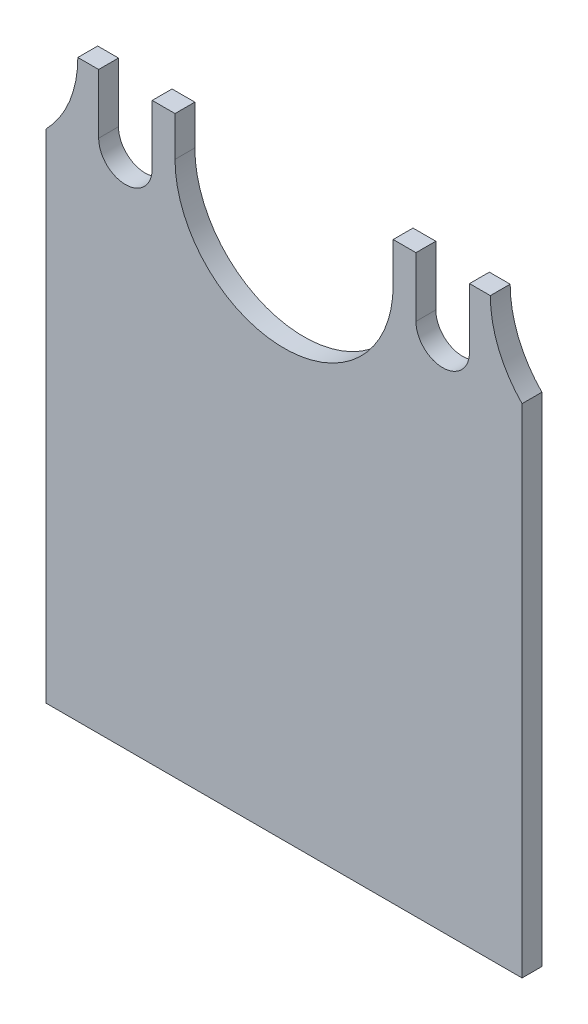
ISO-10303-21;
HEADER;
FILE_DESCRIPTION(('STEP AP214'),'2;1');
FILE_NAME('part.step','',(''),(''),'','','');
FILE_SCHEMA(('AUTOMOTIVE_DESIGN { 1 0 10303 214 1 1 1 1 }'));
ENDSEC;
DATA;
#1=APPLICATION_CONTEXT('core data for automotive mechanical design processes');
#2=APPLICATION_PROTOCOL_DEFINITION('international standard','automotive_design',2000,#1);
#3=PRODUCT_CONTEXT('',#1,'mechanical');
#4=PRODUCT('Part','Part','',(#3));
#5=PRODUCT_RELATED_PRODUCT_CATEGORY('part','',(#4));
#6=PRODUCT_DEFINITION_FORMATION('','',#4);
#7=PRODUCT_DEFINITION_CONTEXT('part definition',#1,'design');
#8=PRODUCT_DEFINITION('design','',#6,#7);
#9=PRODUCT_DEFINITION_SHAPE('','',#8);
#10=(LENGTH_UNIT() NAMED_UNIT(*) SI_UNIT(.MILLI.,.METRE.));
#11=(NAMED_UNIT(*) PLANE_ANGLE_UNIT() SI_UNIT($,.RADIAN.));
#12=(NAMED_UNIT(*) SI_UNIT($,.STERADIAN.) SOLID_ANGLE_UNIT());
#13=UNCERTAINTY_MEASURE_WITH_UNIT(LENGTH_MEASURE(1.E-05),#10,'distance_accuracy_value','');
#14=(GEOMETRIC_REPRESENTATION_CONTEXT(3) GLOBAL_UNCERTAINTY_ASSIGNED_CONTEXT((#13)) GLOBAL_UNIT_ASSIGNED_CONTEXT((#10,
#11,#12)) REPRESENTATION_CONTEXT('',''));
#15=CARTESIAN_POINT('',(0.,0.,0.));
#16=DIRECTION('',(0.,0.,1.));
#17=DIRECTION('',(1.,0.,0.));
#18=AXIS2_PLACEMENT_3D('',#15,#16,#17);
#19=CARTESIAN_POINT('',(0.,0.,5.));
#20=DIRECTION('',(1.,0.,0.));
#21=DIRECTION('',(0.,0.,-1.));
#22=AXIS2_PLACEMENT_3D('',#19,#20,#21);
#23=PLANE('',#22);
#24=DIRECTION('',(0.,-1.,0.));
#25=VECTOR('',#24,1.);
#26=CARTESIAN_POINT('',(0.,0.,0.));
#27=LINE('',#26,#25);
#28=CARTESIAN_POINT('',(0.,125.404082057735,0.));
#29=VERTEX_POINT('',#28);
#30=CARTESIAN_POINT('',(0.,0.,0.));
#31=VERTEX_POINT('',#30);
#32=EDGE_CURVE('E157',#29,#31,#27,.T.);
#33=ORIENTED_EDGE('',*,*,#32,.T.);
#34=DIRECTION('',(0.,0.,-1.));
#35=VECTOR('',#34,1.);
#36=CARTESIAN_POINT('',(0.,0.,5.));
#37=LINE('',#36,#35);
#38=CARTESIAN_POINT('',(0.,0.,5.));
#39=VERTEX_POINT('',#38);
#40=EDGE_CURVE('E11',#39,#31,#37,.T.);
#41=ORIENTED_EDGE('',*,*,#40,.F.);
#42=DIRECTION('',(0.,-1.,0.));
#43=VECTOR('',#42,1.);
#44=CARTESIAN_POINT('',(0.,0.,5.));
#45=LINE('',#44,#43);
#46=CARTESIAN_POINT('',(0.,125.404082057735,5.));
#47=VERTEX_POINT('',#46);
#48=EDGE_CURVE('E204',#47,#39,#45,.T.);
#49=ORIENTED_EDGE('',*,*,#48,.F.);
#50=DIRECTION('',(0.,0.,-1.));
#51=VECTOR('',#50,1.);
#52=CARTESIAN_POINT('',(0.,125.404082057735,5.));
#53=LINE('',#52,#51);
#54=EDGE_CURVE('E170',#47,#29,#53,.T.);
#55=ORIENTED_EDGE('',*,*,#54,.T.);
#56=EDGE_LOOP('',(#33,#41,#49,#55));
#57=FACE_BOUND('',#56,.T.);
#58=ADVANCED_FACE('F29',(#57),#23,.F.);
#59=CARTESIAN_POINT('',(0.,0.,5.));
#60=DIRECTION('',(0.,1.,0.));
#61=DIRECTION('',(0.,0.,1.));
#62=AXIS2_PLACEMENT_3D('',#59,#60,#61);
#63=PLANE('',#62);
#64=DIRECTION('',(1.,0.,0.));
#65=VECTOR('',#64,1.);
#66=CARTESIAN_POINT('',(0.,0.,0.));
#67=LINE('',#66,#65);
#68=CARTESIAN_POINT('',(120.,0.,0.));
#69=VERTEX_POINT('',#68);
#70=EDGE_CURVE('E153',#31,#69,#67,.T.);
#71=ORIENTED_EDGE('',*,*,#70,.T.);
#72=DIRECTION('',(0.,0.,-1.));
#73=VECTOR('',#72,1.);
#74=CARTESIAN_POINT('',(120.,0.,5.));
#75=LINE('',#74,#73);
#76=CARTESIAN_POINT('',(120.,0.,5.));
#77=VERTEX_POINT('',#76);
#78=EDGE_CURVE('E36',#77,#69,#75,.T.);
#79=ORIENTED_EDGE('',*,*,#78,.F.);
#80=DIRECTION('',(1.,0.,0.));
#81=VECTOR('',#80,1.);
#82=CARTESIAN_POINT('',(0.,0.,5.));
#83=LINE('',#82,#81);
#84=EDGE_CURVE('E166',#39,#77,#83,.T.);
#85=ORIENTED_EDGE('',*,*,#84,.F.);
#86=ORIENTED_EDGE('',*,*,#40,.T.);
#87=EDGE_LOOP('',(#71,#79,#85,#86));
#88=FACE_BOUND('',#87,.T.);
#89=ADVANCED_FACE('F165',(#88),#63,.F.);
#90=CARTESIAN_POINT('',(120.,0.,5.));
#91=DIRECTION('',(-1.,0.,0.));
#92=DIRECTION('',(0.,0.,1.));
#93=AXIS2_PLACEMENT_3D('',#90,#91,#92);
#94=PLANE('',#93);
#95=DIRECTION('',(0.,1.,0.));
#96=VECTOR('',#95,1.);
#97=CARTESIAN_POINT('',(120.,0.,0.));
#98=LINE('',#97,#96);
#99=CARTESIAN_POINT('',(120.,125.404082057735,0.));
#100=VERTEX_POINT('',#99);
#101=EDGE_CURVE('E159',#69,#100,#98,.T.);
#102=ORIENTED_EDGE('',*,*,#101,.T.);
#103=DIRECTION('',(0.,0.,-1.));
#104=VECTOR('',#103,1.);
#105=CARTESIAN_POINT('',(120.,125.404082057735,5.));
#106=LINE('',#105,#104);
#107=CARTESIAN_POINT('',(120.,125.404082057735,5.));
#108=VERTEX_POINT('',#107);
#109=EDGE_CURVE('E280',#108,#100,#106,.T.);
#110=ORIENTED_EDGE('',*,*,#109,.F.);
#111=DIRECTION('',(0.,1.,0.));
#112=VECTOR('',#111,1.);
#113=CARTESIAN_POINT('',(120.,0.,5.));
#114=LINE('',#113,#112);
#115=EDGE_CURVE('E207',#77,#108,#114,.T.);
#116=ORIENTED_EDGE('',*,*,#115,.F.);
#117=ORIENTED_EDGE('',*,*,#78,.T.);
#118=EDGE_LOOP('',(#102,#110,#116,#117));
#119=FACE_BOUND('',#118,.T.);
#120=ADVANCED_FACE('F284',(#119),#94,.F.);
#121=CARTESIAN_POINT('',(140.,145.,5.));
#122=DIRECTION('',(0.,0.,-1.));
#123=DIRECTION('',(-1.,0.,0.));
#124=AXIS2_PLACEMENT_3D('',#121,#122,#123);
#125=CYLINDRICAL_SURFACE('',#124,28.);
#126=CARTESIAN_POINT('',(140.,145.,0.));
#127=DIRECTION('',(0.,0.,-1.));
#128=DIRECTION('',(1.,0.,0.));
#129=AXIS2_PLACEMENT_3D('',#126,#127,#128);
#130=CIRCLE('',#129,28.);
#131=CARTESIAN_POINT('',(112.,145.,0.));
#132=VERTEX_POINT('',#131);
#133=EDGE_CURVE('E174',#100,#132,#130,.T.);
#134=ORIENTED_EDGE('',*,*,#133,.T.);
#135=DIRECTION('',(0.,0.,-1.));
#136=VECTOR('',#135,1.);
#137=CARTESIAN_POINT('',(112.,145.,5.));
#138=LINE('',#137,#136);
#139=CARTESIAN_POINT('',(112.,145.,5.));
#140=VERTEX_POINT('',#139);
#141=EDGE_CURVE('E277',#140,#132,#138,.T.);
#142=ORIENTED_EDGE('',*,*,#141,.F.);
#143=CARTESIAN_POINT('',(140.,145.,5.));
#144=DIRECTION('',(0.,0.,-1.));
#145=DIRECTION('',(1.,0.,0.));
#146=AXIS2_PLACEMENT_3D('',#143,#144,#145);
#147=CIRCLE('',#146,28.);
#148=EDGE_CURVE('E209',#108,#140,#147,.T.);
#149=ORIENTED_EDGE('',*,*,#148,.F.);
#150=ORIENTED_EDGE('',*,*,#109,.T.);
#151=EDGE_LOOP('',(#134,#142,#149,#150));
#152=FACE_BOUND('',#151,.T.);
#153=ADVANCED_FACE('F292',(#152),#125,.F.);
#154=CARTESIAN_POINT('',(106.75,145.,5.));
#155=DIRECTION('',(0.,-1.,0.));
#156=DIRECTION('',(0.,0.,-1.));
#157=AXIS2_PLACEMENT_3D('',#154,#155,#156);
#158=PLANE('',#157);
#159=DIRECTION('',(-1.,0.,0.));
#160=VECTOR('',#159,1.);
#161=CARTESIAN_POINT('',(106.75,145.,0.));
#162=LINE('',#161,#160);
#163=CARTESIAN_POINT('',(106.75,145.,0.));
#164=VERTEX_POINT('',#163);
#165=EDGE_CURVE('E176',#132,#164,#162,.T.);
#166=ORIENTED_EDGE('',*,*,#165,.T.);
#167=DIRECTION('',(0.,0.,-1.));
#168=VECTOR('',#167,1.);
#169=CARTESIAN_POINT('',(106.75,145.,5.));
#170=LINE('',#169,#168);
#171=CARTESIAN_POINT('',(106.75,145.,5.));
#172=VERTEX_POINT('',#171);
#173=EDGE_CURVE('E274',#172,#164,#170,.T.);
#174=ORIENTED_EDGE('',*,*,#173,.F.);
#175=DIRECTION('',(-1.,0.,0.));
#176=VECTOR('',#175,1.);
#177=CARTESIAN_POINT('',(106.75,145.,5.));
#178=LINE('',#177,#176);
#179=EDGE_CURVE('E211',#140,#172,#178,.T.);
#180=ORIENTED_EDGE('',*,*,#179,.F.);
#181=ORIENTED_EDGE('',*,*,#141,.T.);
#182=EDGE_LOOP('',(#166,#174,#180,#181));
#183=FACE_BOUND('',#182,.T.);
#184=ADVANCED_FACE('F295',(#183),#158,.F.);
#185=CARTESIAN_POINT('',(106.75,130.,5.));
#186=DIRECTION('',(1.,0.,0.));
#187=DIRECTION('',(0.,0.,-1.));
#188=AXIS2_PLACEMENT_3D('',#185,#186,#187);
#189=PLANE('',#188);
#190=DIRECTION('',(0.,-1.,0.));
#191=VECTOR('',#190,1.);
#192=CARTESIAN_POINT('',(106.75,130.,0.));
#193=LINE('',#192,#191);
#194=CARTESIAN_POINT('',(106.75,130.,0.));
#195=VERTEX_POINT('',#194);
#196=EDGE_CURVE('E178',#164,#195,#193,.T.);
#197=ORIENTED_EDGE('',*,*,#196,.T.);
#198=DIRECTION('',(0.,0.,-1.));
#199=VECTOR('',#198,1.);
#200=CARTESIAN_POINT('',(106.75,130.,5.));
#201=LINE('',#200,#199);
#202=CARTESIAN_POINT('',(106.75,130.,5.));
#203=VERTEX_POINT('',#202);
#204=EDGE_CURVE('E271',#203,#195,#201,.T.);
#205=ORIENTED_EDGE('',*,*,#204,.F.);
#206=DIRECTION('',(0.,-1.,0.));
#207=VECTOR('',#206,1.);
#208=CARTESIAN_POINT('',(106.75,130.,5.));
#209=LINE('',#208,#207);
#210=EDGE_CURVE('E213',#172,#203,#209,.T.);
#211=ORIENTED_EDGE('',*,*,#210,.F.);
#212=ORIENTED_EDGE('',*,*,#173,.T.);
#213=EDGE_LOOP('',(#197,#205,#211,#212));
#214=FACE_BOUND('',#213,.T.);
#215=ADVANCED_FACE('F300',(#214),#189,.F.);
#216=CARTESIAN_POINT('',(100.,130.,5.));
#217=DIRECTION('',(0.,0.,-1.));
#218=DIRECTION('',(-1.,0.,0.));
#219=AXIS2_PLACEMENT_3D('',#216,#217,#218);
#220=CYLINDRICAL_SURFACE('',#219,6.75000000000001);
#221=CARTESIAN_POINT('',(100.,130.,0.));
#222=DIRECTION('',(0.,0.,-1.));
#223=DIRECTION('',(1.,0.,0.));
#224=AXIS2_PLACEMENT_3D('',#221,#222,#223);
#225=CIRCLE('',#224,6.75000000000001);
#226=CARTESIAN_POINT('',(93.25,130.,0.));
#227=VERTEX_POINT('',#226);
#228=EDGE_CURVE('E180',#195,#227,#225,.T.);
#229=ORIENTED_EDGE('',*,*,#228,.T.);
#230=DIRECTION('',(0.,0.,-1.));
#231=VECTOR('',#230,1.);
#232=CARTESIAN_POINT('',(93.25,130.,5.));
#233=LINE('',#232,#231);
#234=CARTESIAN_POINT('',(93.25,130.,5.));
#235=VERTEX_POINT('',#234);
#236=EDGE_CURVE('E268',#235,#227,#233,.T.);
#237=ORIENTED_EDGE('',*,*,#236,.F.);
#238=CARTESIAN_POINT('',(100.,130.,5.));
#239=DIRECTION('',(0.,0.,-1.));
#240=DIRECTION('',(1.,0.,0.));
#241=AXIS2_PLACEMENT_3D('',#238,#239,#240);
#242=CIRCLE('',#241,6.75000000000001);
#243=EDGE_CURVE('E215',#203,#235,#242,.T.);
#244=ORIENTED_EDGE('',*,*,#243,.F.);
#245=ORIENTED_EDGE('',*,*,#204,.T.);
#246=EDGE_LOOP('',(#229,#237,#244,#245));
#247=FACE_BOUND('',#246,.T.);
#248=ADVANCED_FACE('F306',(#247),#220,.F.);
#249=CARTESIAN_POINT('',(93.25,130.,5.));
#250=DIRECTION('',(-1.,0.,0.));
#251=DIRECTION('',(0.,0.,1.));
#252=AXIS2_PLACEMENT_3D('',#249,#250,#251);
#253=PLANE('',#252);
#254=DIRECTION('',(0.,1.,0.));
#255=VECTOR('',#254,1.);
#256=CARTESIAN_POINT('',(93.25,130.,0.));
#257=LINE('',#256,#255);
#258=CARTESIAN_POINT('',(93.25,145.,0.));
#259=VERTEX_POINT('',#258);
#260=EDGE_CURVE('E182',#227,#259,#257,.T.);
#261=ORIENTED_EDGE('',*,*,#260,.T.);
#262=DIRECTION('',(0.,0.,-1.));
#263=VECTOR('',#262,1.);
#264=CARTESIAN_POINT('',(93.25,145.,5.));
#265=LINE('',#264,#263);
#266=CARTESIAN_POINT('',(93.25,145.,5.));
#267=VERTEX_POINT('',#266);
#268=EDGE_CURVE('E265',#267,#259,#265,.T.);
#269=ORIENTED_EDGE('',*,*,#268,.F.);
#270=DIRECTION('',(0.,1.,0.));
#271=VECTOR('',#270,1.);
#272=CARTESIAN_POINT('',(93.25,130.,5.));
#273=LINE('',#272,#271);
#274=EDGE_CURVE('E217',#235,#267,#273,.T.);
#275=ORIENTED_EDGE('',*,*,#274,.F.);
#276=ORIENTED_EDGE('',*,*,#236,.T.);
#277=EDGE_LOOP('',(#261,#269,#275,#276));
#278=FACE_BOUND('',#277,.T.);
#279=ADVANCED_FACE('F310',(#278),#253,.F.);
#280=CARTESIAN_POINT('',(87.5,145.,5.));
#281=DIRECTION('',(0.,-1.,0.));
#282=DIRECTION('',(0.,0.,-1.));
#283=AXIS2_PLACEMENT_3D('',#280,#281,#282);
#284=PLANE('',#283);
#285=DIRECTION('',(-1.,0.,0.));
#286=VECTOR('',#285,1.);
#287=CARTESIAN_POINT('',(87.5,145.,0.));
#288=LINE('',#287,#286);
#289=CARTESIAN_POINT('',(87.5,145.,0.));
#290=VERTEX_POINT('',#289);
#291=EDGE_CURVE('E184',#259,#290,#288,.T.);
#292=ORIENTED_EDGE('',*,*,#291,.T.);
#293=DIRECTION('',(0.,0.,-1.));
#294=VECTOR('',#293,1.);
#295=CARTESIAN_POINT('',(87.5,145.,5.));
#296=LINE('',#295,#294);
#297=CARTESIAN_POINT('',(87.5,145.,5.));
#298=VERTEX_POINT('',#297);
#299=EDGE_CURVE('E262',#298,#290,#296,.T.);
#300=ORIENTED_EDGE('',*,*,#299,.F.);
#301=DIRECTION('',(-1.,0.,0.));
#302=VECTOR('',#301,1.);
#303=CARTESIAN_POINT('',(87.5,145.,5.));
#304=LINE('',#303,#302);
#305=EDGE_CURVE('E219',#267,#298,#304,.T.);
#306=ORIENTED_EDGE('',*,*,#305,.F.);
#307=ORIENTED_EDGE('',*,*,#268,.T.);
#308=EDGE_LOOP('',(#292,#300,#306,#307));
#309=FACE_BOUND('',#308,.T.);
#310=ADVANCED_FACE('F315',(#309),#284,.F.);
#311=CARTESIAN_POINT('',(87.5,135.,5.));
#312=DIRECTION('',(1.,0.,0.));
#313=DIRECTION('',(0.,1.,0.));
#314=AXIS2_PLACEMENT_3D('',#311,#312,#313);
#315=PLANE('',#314);
#316=DIRECTION('',(0.,-1.,0.));
#317=VECTOR('',#316,1.);
#318=CARTESIAN_POINT('',(87.5,135.,0.));
#319=LINE('',#318,#317);
#320=CARTESIAN_POINT('',(87.5,135.,0.));
#321=VERTEX_POINT('',#320);
#322=EDGE_CURVE('E186',#290,#321,#319,.T.);
#323=ORIENTED_EDGE('',*,*,#322,.T.);
#324=DIRECTION('',(0.,0.,-1.));
#325=VECTOR('',#324,1.);
#326=CARTESIAN_POINT('',(87.5,135.,5.));
#327=LINE('',#326,#325);
#328=CARTESIAN_POINT('',(87.5,135.,5.));
#329=VERTEX_POINT('',#328);
#330=EDGE_CURVE('E259',#329,#321,#327,.T.);
#331=ORIENTED_EDGE('',*,*,#330,.F.);
#332=DIRECTION('',(0.,-1.,0.));
#333=VECTOR('',#332,1.);
#334=CARTESIAN_POINT('',(87.5,135.,5.));
#335=LINE('',#334,#333);
#336=EDGE_CURVE('E221',#298,#329,#335,.T.);
#337=ORIENTED_EDGE('',*,*,#336,.F.);
#338=ORIENTED_EDGE('',*,*,#299,.T.);
#339=EDGE_LOOP('',(#323,#331,#337,#338));
#340=FACE_BOUND('',#339,.T.);
#341=ADVANCED_FACE('F321',(#340),#315,.F.);
#342=CARTESIAN_POINT('',(60.,135.,5.));
#343=DIRECTION('',(0.,0.,-1.));
#344=DIRECTION('',(-1.,0.,0.));
#345=AXIS2_PLACEMENT_3D('',#342,#343,#344);
#346=CYLINDRICAL_SURFACE('',#345,27.5);
#347=CARTESIAN_POINT('',(60.,135.,0.));
#348=DIRECTION('',(0.,0.,-1.));
#349=DIRECTION('',(1.,0.,0.));
#350=AXIS2_PLACEMENT_3D('',#347,#348,#349);
#351=CIRCLE('',#350,27.5);
#352=CARTESIAN_POINT('',(32.5,135.,0.));
#353=VERTEX_POINT('',#352);
#354=EDGE_CURVE('E188',#321,#353,#351,.T.);
#355=ORIENTED_EDGE('',*,*,#354,.T.);
#356=DIRECTION('',(0.,0.,-1.));
#357=VECTOR('',#356,1.);
#358=CARTESIAN_POINT('',(32.5,135.,5.));
#359=LINE('',#358,#357);
#360=CARTESIAN_POINT('',(32.5,135.,5.));
#361=VERTEX_POINT('',#360);
#362=EDGE_CURVE('E256',#361,#353,#359,.T.);
#363=ORIENTED_EDGE('',*,*,#362,.F.);
#364=CARTESIAN_POINT('',(60.,135.,5.));
#365=DIRECTION('',(0.,0.,-1.));
#366=DIRECTION('',(1.,0.,0.));
#367=AXIS2_PLACEMENT_3D('',#364,#365,#366);
#368=CIRCLE('',#367,27.5);
#369=EDGE_CURVE('E223',#329,#361,#368,.T.);
#370=ORIENTED_EDGE('',*,*,#369,.F.);
#371=ORIENTED_EDGE('',*,*,#330,.T.);
#372=EDGE_LOOP('',(#355,#363,#370,#371));
#373=FACE_BOUND('',#372,.T.);
#374=ADVANCED_FACE('F325',(#373),#346,.F.);
#375=CARTESIAN_POINT('',(32.5,135.,5.));
#376=DIRECTION('',(-1.,0.,0.));
#377=DIRECTION('',(0.,0.,1.));
#378=AXIS2_PLACEMENT_3D('',#375,#376,#377);
#379=PLANE('',#378);
#380=DIRECTION('',(0.,1.,0.));
#381=VECTOR('',#380,1.);
#382=CARTESIAN_POINT('',(32.5,135.,0.));
#383=LINE('',#382,#381);
#384=CARTESIAN_POINT('',(32.5,145.,0.));
#385=VERTEX_POINT('',#384);
#386=EDGE_CURVE('E190',#353,#385,#383,.T.);
#387=ORIENTED_EDGE('',*,*,#386,.T.);
#388=DIRECTION('',(0.,0.,-1.));
#389=VECTOR('',#388,1.);
#390=CARTESIAN_POINT('',(32.5,145.,5.));
#391=LINE('',#390,#389);
#392=CARTESIAN_POINT('',(32.5,145.,5.));
#393=VERTEX_POINT('',#392);
#394=EDGE_CURVE('E253',#393,#385,#391,.T.);
#395=ORIENTED_EDGE('',*,*,#394,.F.);
#396=DIRECTION('',(0.,1.,0.));
#397=VECTOR('',#396,1.);
#398=CARTESIAN_POINT('',(32.5,135.,5.));
#399=LINE('',#398,#397);
#400=EDGE_CURVE('E225',#361,#393,#399,.T.);
#401=ORIENTED_EDGE('',*,*,#400,.F.);
#402=ORIENTED_EDGE('',*,*,#362,.T.);
#403=EDGE_LOOP('',(#387,#395,#401,#402));
#404=FACE_BOUND('',#403,.T.);
#405=ADVANCED_FACE('F330',(#404),#379,.F.);
#406=CARTESIAN_POINT('',(26.75,145.,5.));
#407=DIRECTION('',(0.,-1.,0.));
#408=DIRECTION('',(0.,0.,-1.));
#409=AXIS2_PLACEMENT_3D('',#406,#407,#408);
#410=PLANE('',#409);
#411=DIRECTION('',(-1.,0.,0.));
#412=VECTOR('',#411,1.);
#413=CARTESIAN_POINT('',(26.75,145.,0.));
#414=LINE('',#413,#412);
#415=CARTESIAN_POINT('',(26.75,145.,0.));
#416=VERTEX_POINT('',#415);
#417=EDGE_CURVE('E192',#385,#416,#414,.T.);
#418=ORIENTED_EDGE('',*,*,#417,.T.);
#419=DIRECTION('',(0.,0.,-1.));
#420=VECTOR('',#419,1.);
#421=CARTESIAN_POINT('',(26.75,145.,5.));
#422=LINE('',#421,#420);
#423=CARTESIAN_POINT('',(26.75,145.,5.));
#424=VERTEX_POINT('',#423);
#425=EDGE_CURVE('E250',#424,#416,#422,.T.);
#426=ORIENTED_EDGE('',*,*,#425,.F.);
#427=DIRECTION('',(-1.,0.,0.));
#428=VECTOR('',#427,1.);
#429=CARTESIAN_POINT('',(26.75,145.,5.));
#430=LINE('',#429,#428);
#431=EDGE_CURVE('E227',#393,#424,#430,.T.);
#432=ORIENTED_EDGE('',*,*,#431,.F.);
#433=ORIENTED_EDGE('',*,*,#394,.T.);
#434=EDGE_LOOP('',(#418,#426,#432,#433));
#435=FACE_BOUND('',#434,.T.);
#436=ADVANCED_FACE('F336',(#435),#410,.F.);
#437=CARTESIAN_POINT('',(26.75,130.,5.));
#438=DIRECTION('',(1.,0.,0.));
#439=DIRECTION('',(0.,1.,0.));
#440=AXIS2_PLACEMENT_3D('',#437,#438,#439);
#441=PLANE('',#440);
#442=DIRECTION('',(0.,-1.,0.));
#443=VECTOR('',#442,1.);
#444=CARTESIAN_POINT('',(26.75,130.,0.));
#445=LINE('',#444,#443);
#446=CARTESIAN_POINT('',(26.75,130.,0.));
#447=VERTEX_POINT('',#446);
#448=EDGE_CURVE('E194',#416,#447,#445,.T.);
#449=ORIENTED_EDGE('',*,*,#448,.T.);
#450=DIRECTION('',(0.,0.,-1.));
#451=VECTOR('',#450,1.);
#452=CARTESIAN_POINT('',(26.75,130.,5.));
#453=LINE('',#452,#451);
#454=CARTESIAN_POINT('',(26.75,130.,5.));
#455=VERTEX_POINT('',#454);
#456=EDGE_CURVE('E247',#455,#447,#453,.T.);
#457=ORIENTED_EDGE('',*,*,#456,.F.);
#458=DIRECTION('',(0.,-1.,0.));
#459=VECTOR('',#458,1.);
#460=CARTESIAN_POINT('',(26.75,130.,5.));
#461=LINE('',#460,#459);
#462=EDGE_CURVE('E229',#424,#455,#461,.T.);
#463=ORIENTED_EDGE('',*,*,#462,.F.);
#464=ORIENTED_EDGE('',*,*,#425,.T.);
#465=EDGE_LOOP('',(#449,#457,#463,#464));
#466=FACE_BOUND('',#465,.T.);
#467=ADVANCED_FACE('F340',(#466),#441,.F.);
#468=CARTESIAN_POINT('',(20.,130.,5.));
#469=DIRECTION('',(0.,0.,-1.));
#470=DIRECTION('',(-1.,0.,0.));
#471=AXIS2_PLACEMENT_3D('',#468,#469,#470);
#472=CYLINDRICAL_SURFACE('',#471,6.75);
#473=CARTESIAN_POINT('',(20.,130.,0.));
#474=DIRECTION('',(0.,0.,-1.));
#475=DIRECTION('',(1.,0.,0.));
#476=AXIS2_PLACEMENT_3D('',#473,#474,#475);
#477=CIRCLE('',#476,6.75);
#478=CARTESIAN_POINT('',(13.25,130.,0.));
#479=VERTEX_POINT('',#478);
#480=EDGE_CURVE('E196',#447,#479,#477,.T.);
#481=ORIENTED_EDGE('',*,*,#480,.T.);
#482=DIRECTION('',(0.,0.,-1.));
#483=VECTOR('',#482,1.);
#484=CARTESIAN_POINT('',(13.25,130.,5.));
#485=LINE('',#484,#483);
#486=CARTESIAN_POINT('',(13.25,130.,5.));
#487=VERTEX_POINT('',#486);
#488=EDGE_CURVE('E244',#487,#479,#485,.T.);
#489=ORIENTED_EDGE('',*,*,#488,.F.);
#490=CARTESIAN_POINT('',(20.,130.,5.));
#491=DIRECTION('',(0.,0.,-1.));
#492=DIRECTION('',(1.,0.,0.));
#493=AXIS2_PLACEMENT_3D('',#490,#491,#492);
#494=CIRCLE('',#493,6.75);
#495=EDGE_CURVE('E231',#455,#487,#494,.T.);
#496=ORIENTED_EDGE('',*,*,#495,.F.);
#497=ORIENTED_EDGE('',*,*,#456,.T.);
#498=EDGE_LOOP('',(#481,#489,#496,#497));
#499=FACE_BOUND('',#498,.T.);
#500=ADVANCED_FACE('F345',(#499),#472,.F.);
#501=CARTESIAN_POINT('',(13.25,130.,5.));
#502=DIRECTION('',(-1.,0.,0.));
#503=DIRECTION('',(0.,-1.,0.));
#504=AXIS2_PLACEMENT_3D('',#501,#502,#503);
#505=PLANE('',#504);
#506=DIRECTION('',(0.,1.,0.));
#507=VECTOR('',#506,1.);
#508=CARTESIAN_POINT('',(13.25,130.,0.));
#509=LINE('',#508,#507);
#510=CARTESIAN_POINT('',(13.25,145.,0.));
#511=VERTEX_POINT('',#510);
#512=EDGE_CURVE('E198',#479,#511,#509,.T.);
#513=ORIENTED_EDGE('',*,*,#512,.T.);
#514=DIRECTION('',(0.,0.,-1.));
#515=VECTOR('',#514,1.);
#516=CARTESIAN_POINT('',(13.25,145.,5.));
#517=LINE('',#516,#515);
#518=CARTESIAN_POINT('',(13.25,145.,5.));
#519=VERTEX_POINT('',#518);
#520=EDGE_CURVE('E241',#519,#511,#517,.T.);
#521=ORIENTED_EDGE('',*,*,#520,.F.);
#522=DIRECTION('',(0.,1.,0.));
#523=VECTOR('',#522,1.);
#524=CARTESIAN_POINT('',(13.25,130.,5.));
#525=LINE('',#524,#523);
#526=EDGE_CURVE('E233',#487,#519,#525,.T.);
#527=ORIENTED_EDGE('',*,*,#526,.F.);
#528=ORIENTED_EDGE('',*,*,#488,.T.);
#529=EDGE_LOOP('',(#513,#521,#527,#528));
#530=FACE_BOUND('',#529,.T.);
#531=ADVANCED_FACE('F349',(#530),#505,.F.);
#532=CARTESIAN_POINT('',(7.99999999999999,145.,5.));
#533=DIRECTION('',(0.,-1.,0.));
#534=DIRECTION('',(0.,0.,-1.));
#535=AXIS2_PLACEMENT_3D('',#532,#533,#534);
#536=PLANE('',#535);
#537=DIRECTION('',(-1.,0.,0.));
#538=VECTOR('',#537,1.);
#539=CARTESIAN_POINT('',(7.99999999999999,145.,0.));
#540=LINE('',#539,#538);
#541=CARTESIAN_POINT('',(7.99999999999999,145.,0.));
#542=VERTEX_POINT('',#541);
#543=EDGE_CURVE('E200',#511,#542,#540,.T.);
#544=ORIENTED_EDGE('',*,*,#543,.T.);
#545=DIRECTION('',(0.,0.,-1.));
#546=VECTOR('',#545,1.);
#547=CARTESIAN_POINT('',(7.99999999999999,145.,5.));
#548=LINE('',#547,#546);
#549=CARTESIAN_POINT('',(7.99999999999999,145.,5.));
#550=VERTEX_POINT('',#549);
#551=EDGE_CURVE('E238',#550,#542,#548,.T.);
#552=ORIENTED_EDGE('',*,*,#551,.F.);
#553=DIRECTION('',(-1.,0.,0.));
#554=VECTOR('',#553,1.);
#555=CARTESIAN_POINT('',(7.99999999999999,145.,5.));
#556=LINE('',#555,#554);
#557=EDGE_CURVE('E48',#519,#550,#556,.T.);
#558=ORIENTED_EDGE('',*,*,#557,.F.);
#559=ORIENTED_EDGE('',*,*,#520,.T.);
#560=EDGE_LOOP('',(#544,#552,#558,#559));
#561=FACE_BOUND('',#560,.T.);
#562=ADVANCED_FACE('F353',(#561),#536,.F.);
#563=CARTESIAN_POINT('',(-20.,145.,5.));
#564=DIRECTION('',(0.,0.,-1.));
#565=DIRECTION('',(-1.,0.,0.));
#566=AXIS2_PLACEMENT_3D('',#563,#564,#565);
#567=CYLINDRICAL_SURFACE('',#566,28.);
#568=CARTESIAN_POINT('',(-20.,145.,0.));
#569=DIRECTION('',(0.,0.,-1.));
#570=DIRECTION('',(1.,0.,0.));
#571=AXIS2_PLACEMENT_3D('',#568,#569,#570);
#572=CIRCLE('',#571,28.);
#573=EDGE_CURVE('E202',#542,#29,#572,.T.);
#574=ORIENTED_EDGE('',*,*,#573,.T.);
#575=ORIENTED_EDGE('',*,*,#54,.F.);
#576=CARTESIAN_POINT('',(-20.,145.,5.));
#577=DIRECTION('',(0.,0.,-1.));
#578=DIRECTION('',(1.,0.,0.));
#579=AXIS2_PLACEMENT_3D('',#576,#577,#578);
#580=CIRCLE('',#579,28.);
#581=EDGE_CURVE('E43',#550,#47,#580,.T.);
#582=ORIENTED_EDGE('',*,*,#581,.F.);
#583=ORIENTED_EDGE('',*,*,#551,.T.);
#584=EDGE_LOOP('',(#574,#575,#582,#583));
#585=FACE_BOUND('',#584,.T.);
#586=ADVANCED_FACE('F355',(#585),#567,.F.);
#587=CARTESIAN_POINT('',(-20.,145.,5.));
#588=DIRECTION('',(0.,0.,1.));
#589=DIRECTION('',(1.,0.,0.));
#590=AXIS2_PLACEMENT_3D('',#587,#588,#589);
#591=PLANE('',#590);
#592=ORIENTED_EDGE('',*,*,#48,.T.);
#593=ORIENTED_EDGE('',*,*,#84,.T.);
#594=ORIENTED_EDGE('',*,*,#115,.T.);
#595=ORIENTED_EDGE('',*,*,#148,.T.);
#596=ORIENTED_EDGE('',*,*,#179,.T.);
#597=ORIENTED_EDGE('',*,*,#210,.T.);
#598=ORIENTED_EDGE('',*,*,#243,.T.);
#599=ORIENTED_EDGE('',*,*,#274,.T.);
#600=ORIENTED_EDGE('',*,*,#305,.T.);
#601=ORIENTED_EDGE('',*,*,#336,.T.);
#602=ORIENTED_EDGE('',*,*,#369,.T.);
#603=ORIENTED_EDGE('',*,*,#400,.T.);
#604=ORIENTED_EDGE('',*,*,#431,.T.);
#605=ORIENTED_EDGE('',*,*,#462,.T.);
#606=ORIENTED_EDGE('',*,*,#495,.T.);
#607=ORIENTED_EDGE('',*,*,#526,.T.);
#608=ORIENTED_EDGE('',*,*,#557,.T.);
#609=ORIENTED_EDGE('',*,*,#581,.T.);
#610=EDGE_LOOP('',(#592,#593,#594,#595,#596,#597,#598,#599,#600,#601,#602,#603,#604,#605,#606,
#607,#608,#609));
#611=FACE_BOUND('',#610,.T.);
#612=ADVANCED_FACE('F287',(#611),#591,.T.);
#613=CARTESIAN_POINT('',(-20.,145.,0.));
#614=DIRECTION('',(0.,0.,1.));
#615=DIRECTION('',(1.,0.,0.));
#616=AXIS2_PLACEMENT_3D('',#613,#614,#615);
#617=PLANE('',#616);
#618=ORIENTED_EDGE('',*,*,#32,.F.);
#619=ORIENTED_EDGE('',*,*,#573,.F.);
#620=ORIENTED_EDGE('',*,*,#543,.F.);
#621=ORIENTED_EDGE('',*,*,#512,.F.);
#622=ORIENTED_EDGE('',*,*,#480,.F.);
#623=ORIENTED_EDGE('',*,*,#448,.F.);
#624=ORIENTED_EDGE('',*,*,#417,.F.);
#625=ORIENTED_EDGE('',*,*,#386,.F.);
#626=ORIENTED_EDGE('',*,*,#354,.F.);
#627=ORIENTED_EDGE('',*,*,#322,.F.);
#628=ORIENTED_EDGE('',*,*,#291,.F.);
#629=ORIENTED_EDGE('',*,*,#260,.F.);
#630=ORIENTED_EDGE('',*,*,#228,.F.);
#631=ORIENTED_EDGE('',*,*,#196,.F.);
#632=ORIENTED_EDGE('',*,*,#165,.F.);
#633=ORIENTED_EDGE('',*,*,#133,.F.);
#634=ORIENTED_EDGE('',*,*,#101,.F.);
#635=ORIENTED_EDGE('',*,*,#70,.F.);
#636=EDGE_LOOP('',(#618,#619,#620,#621,#622,#623,#624,#625,#626,#627,#628,#629,#630,#631,#632,
#633,#634,#635));
#637=FACE_BOUND('',#636,.T.);
#638=ADVANCED_FACE('F154',(#637),#617,.F.);
#639=CLOSED_SHELL('',(#58,#89,#120,#153,#184,#215,#248,#279,#310,#341,#374,#405,#436,#467,#500,
#531,#562,#586,#612,#638));
#640=MANIFOLD_SOLID_BREP('B2',#639);
#641=ADVANCED_BREP_SHAPE_REPRESENTATION('',(#18,#640),#14);
#642=SHAPE_DEFINITION_REPRESENTATION(#9,#641);
ENDSEC;
END-ISO-10303-21;
